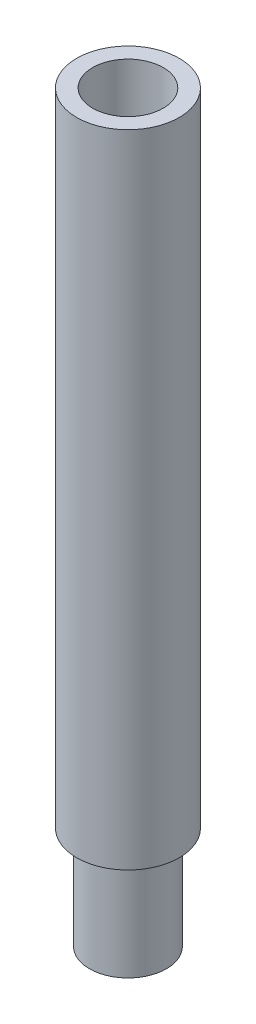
ISO-10303-21;
HEADER;
FILE_DESCRIPTION(('STEP AP214'),'2;1');
FILE_NAME('part.step','',(''),(''),'','','');
FILE_SCHEMA(('AUTOMOTIVE_DESIGN { 1 0 10303 214 1 1 1 1 }'));
ENDSEC;
DATA;
#1=APPLICATION_CONTEXT('core data for automotive mechanical design processes');
#2=APPLICATION_PROTOCOL_DEFINITION('international standard','automotive_design',2000,#1);
#3=PRODUCT_CONTEXT('',#1,'mechanical');
#4=PRODUCT('Part','Part','',(#3));
#5=PRODUCT_RELATED_PRODUCT_CATEGORY('part','',(#4));
#6=PRODUCT_DEFINITION_FORMATION('','',#4);
#7=PRODUCT_DEFINITION_CONTEXT('part definition',#1,'design');
#8=PRODUCT_DEFINITION('design','',#6,#7);
#9=PRODUCT_DEFINITION_SHAPE('','',#8);
#10=(LENGTH_UNIT() NAMED_UNIT(*) SI_UNIT(.MILLI.,.METRE.));
#11=(NAMED_UNIT(*) PLANE_ANGLE_UNIT() SI_UNIT($,.RADIAN.));
#12=(NAMED_UNIT(*) SI_UNIT($,.STERADIAN.) SOLID_ANGLE_UNIT());
#13=UNCERTAINTY_MEASURE_WITH_UNIT(LENGTH_MEASURE(1.E-05),#10,'distance_accuracy_value','');
#14=(GEOMETRIC_REPRESENTATION_CONTEXT(3) GLOBAL_UNCERTAINTY_ASSIGNED_CONTEXT((#13)) GLOBAL_UNIT_ASSIGNED_CONTEXT((#10,
#11,#12)) REPRESENTATION_CONTEXT('',''));
#15=CARTESIAN_POINT('',(0.,0.,0.));
#16=DIRECTION('',(0.,0.,1.));
#17=DIRECTION('',(1.,0.,0.));
#18=AXIS2_PLACEMENT_3D('',#15,#16,#17);
#19=CARTESIAN_POINT('',(0.,0.,0.));
#20=DIRECTION('',(0.,1.,0.));
#21=DIRECTION('',(0.,0.,1.));
#22=AXIS2_PLACEMENT_3D('',#19,#20,#21);
#23=PLANE('',#22);
#24=CARTESIAN_POINT('',(0.,0.,0.));
#25=DIRECTION('',(0.,-1.,0.));
#26=DIRECTION('',(0.,0.,-1.));
#27=AXIS2_PLACEMENT_3D('',#24,#25,#26);
#28=CIRCLE('',#27,3.45439999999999);
#29=CARTESIAN_POINT('',(0.,0.,-3.45439999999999));
#30=VERTEX_POINT('',#29);
#31=EDGE_CURVE('E52',#30,#30,#28,.T.);
#32=ORIENTED_EDGE('',*,*,#31,.F.);
#33=EDGE_LOOP('',(#32));
#34=FACE_BOUND('',#33,.T.);
#35=CARTESIAN_POINT('',(0.,0.,0.));
#36=DIRECTION('',(0.,1.,0.));
#37=DIRECTION('',(0.,0.,1.));
#38=AXIS2_PLACEMENT_3D('',#35,#36,#37);
#39=CIRCLE('',#38,9.525);
#40=CARTESIAN_POINT('',(0.,0.,9.525));
#41=VERTEX_POINT('',#40);
#42=EDGE_CURVE('E11',#41,#41,#39,.T.);
#43=ORIENTED_EDGE('',*,*,#42,.F.);
#44=EDGE_LOOP('',(#43));
#45=FACE_BOUND('',#44,.T.);
#46=ADVANCED_FACE('F32',(#34,#45),#23,.F.);
#47=CARTESIAN_POINT('',(0.,0.,0.));
#48=DIRECTION('',(0.,1.,0.));
#49=DIRECTION('',(0.,0.,1.));
#50=AXIS2_PLACEMENT_3D('',#47,#48,#49);
#51=CYLINDRICAL_SURFACE('',#50,9.525);
#52=CARTESIAN_POINT('',(0.,25.4,0.));
#53=DIRECTION('',(0.,1.,0.));
#54=DIRECTION('',(0.,0.,1.));
#55=AXIS2_PLACEMENT_3D('',#52,#53,#54);
#56=CIRCLE('',#55,9.525);
#57=CARTESIAN_POINT('',(0.,25.4,9.525));
#58=VERTEX_POINT('',#57);
#59=EDGE_CURVE('E38',#58,#58,#56,.T.);
#60=ORIENTED_EDGE('',*,*,#59,.F.);
#61=EDGE_LOOP('',(#60));
#62=FACE_BOUND('',#61,.T.);
#63=ORIENTED_EDGE('',*,*,#42,.T.);
#64=EDGE_LOOP('',(#63));
#65=FACE_BOUND('',#64,.T.);
#66=ADVANCED_FACE('F72',(#62,#65),#51,.T.);
#67=CARTESIAN_POINT('',(9.525,25.4,0.));
#68=DIRECTION('',(0.,1.,0.));
#69=DIRECTION('',(0.,0.,1.));
#70=AXIS2_PLACEMENT_3D('',#67,#68,#69);
#71=PLANE('',#70);
#72=CARTESIAN_POINT('',(0.,25.4,0.));
#73=DIRECTION('',(0.,1.,0.));
#74=DIRECTION('',(0.,0.,1.));
#75=AXIS2_PLACEMENT_3D('',#72,#73,#74);
#76=CIRCLE('',#75,12.7);
#77=CARTESIAN_POINT('',(0.,25.4,12.7));
#78=VERTEX_POINT('',#77);
#79=EDGE_CURVE('E65',#78,#78,#76,.T.);
#80=ORIENTED_EDGE('',*,*,#79,.F.);
#81=EDGE_LOOP('',(#80));
#82=FACE_BOUND('',#81,.T.);
#83=ORIENTED_EDGE('',*,*,#59,.T.);
#84=EDGE_LOOP('',(#83));
#85=FACE_BOUND('',#84,.T.);
#86=ADVANCED_FACE('F70',(#82,#85),#71,.F.);
#87=CARTESIAN_POINT('',(0.,0.,0.));
#88=DIRECTION('',(0.,1.,0.));
#89=DIRECTION('',(0.,0.,1.));
#90=AXIS2_PLACEMENT_3D('',#87,#88,#89);
#91=CYLINDRICAL_SURFACE('',#90,12.7);
#92=CARTESIAN_POINT('',(0.,184.15,0.));
#93=DIRECTION('',(0.,1.,0.));
#94=DIRECTION('',(0.,0.,1.));
#95=AXIS2_PLACEMENT_3D('',#92,#93,#94);
#96=CIRCLE('',#95,12.7);
#97=CARTESIAN_POINT('',(0.,184.15,12.7));
#98=VERTEX_POINT('',#97);
#99=EDGE_CURVE('E62',#98,#98,#96,.T.);
#100=ORIENTED_EDGE('',*,*,#99,.F.);
#101=EDGE_LOOP('',(#100));
#102=FACE_BOUND('',#101,.T.);
#103=ORIENTED_EDGE('',*,*,#79,.T.);
#104=EDGE_LOOP('',(#103));
#105=FACE_BOUND('',#104,.T.);
#106=ADVANCED_FACE('F98',(#102,#105),#91,.T.);
#107=CARTESIAN_POINT('',(12.7,184.15,0.));
#108=DIRECTION('',(0.,-1.,0.));
#109=DIRECTION('',(0.,0.,-1.));
#110=AXIS2_PLACEMENT_3D('',#107,#108,#109);
#111=PLANE('',#110);
#112=CARTESIAN_POINT('',(0.,184.15,0.));
#113=DIRECTION('',(0.,1.,0.));
#114=DIRECTION('',(0.,0.,1.));
#115=AXIS2_PLACEMENT_3D('',#112,#113,#114);
#116=CIRCLE('',#115,8.73124999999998);
#117=CARTESIAN_POINT('',(0.,184.15,8.73124999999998));
#118=VERTEX_POINT('',#117);
#119=EDGE_CURVE('E55',#118,#118,#116,.T.);
#120=ORIENTED_EDGE('',*,*,#119,.F.);
#121=EDGE_LOOP('',(#120));
#122=FACE_BOUND('',#121,.T.);
#123=ORIENTED_EDGE('',*,*,#99,.T.);
#124=EDGE_LOOP('',(#123));
#125=FACE_BOUND('',#124,.T.);
#126=ADVANCED_FACE('F94',(#122,#125),#111,.F.);
#127=CARTESIAN_POINT('',(0.,0.,0.));
#128=DIRECTION('',(0.,1.,0.));
#129=DIRECTION('',(0.,0.,1.));
#130=AXIS2_PLACEMENT_3D('',#127,#128,#129);
#131=CYLINDRICAL_SURFACE('',#130,8.73124999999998);
#132=CARTESIAN_POINT('',(0.,155.575,0.));
#133=DIRECTION('',(0.,1.,0.));
#134=DIRECTION('',(0.,0.,1.));
#135=AXIS2_PLACEMENT_3D('',#132,#133,#134);
#136=CIRCLE('',#135,8.73124999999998);
#137=CARTESIAN_POINT('',(0.,155.575,8.73124999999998));
#138=VERTEX_POINT('',#137);
#139=EDGE_CURVE('E51',#138,#138,#136,.T.);
#140=ORIENTED_EDGE('',*,*,#139,.F.);
#141=EDGE_LOOP('',(#140));
#142=FACE_BOUND('',#141,.T.);
#143=ORIENTED_EDGE('',*,*,#119,.T.);
#144=EDGE_LOOP('',(#143));
#145=FACE_BOUND('',#144,.T.);
#146=ADVANCED_FACE('F90',(#142,#145),#131,.F.);
#147=CARTESIAN_POINT('',(8.73124999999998,155.575,0.));
#148=DIRECTION('',(0.,-1.,0.));
#149=DIRECTION('',(0.,0.,-1.));
#150=AXIS2_PLACEMENT_3D('',#147,#148,#149);
#151=PLANE('',#150);
#152=ORIENTED_EDGE('',*,*,#139,.T.);
#153=EDGE_LOOP('',(#152));
#154=FACE_BOUND('',#153,.T.);
#155=ADVANCED_FACE('F45',(#154),#151,.F.);
#156=CARTESIAN_POINT('',(0.,21.336,0.));
#157=DIRECTION('',(0.,-1.,0.));
#158=DIRECTION('',(0.,0.,-1.));
#159=AXIS2_PLACEMENT_3D('',#156,#157,#158);
#160=CONICAL_SURFACE('',#159,3.45439999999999,1.02974425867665);
#161=CARTESIAN_POINT('',(0.,23.4116129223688,0.));
#162=VERTEX_POINT('',#161);
#163=VERTEX_LOOP('',#162);
#164=FACE_BOUND('',#163,.T.);
#165=CARTESIAN_POINT('',(0.,21.336,0.));
#166=DIRECTION('',(0.,-1.,0.));
#167=DIRECTION('',(0.,0.,-1.));
#168=AXIS2_PLACEMENT_3D('',#165,#166,#167);
#169=CIRCLE('',#168,3.45439999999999);
#170=CARTESIAN_POINT('',(0.,21.336,-3.45439999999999));
#171=VERTEX_POINT('',#170);
#172=EDGE_CURVE('E49',#171,#171,#169,.T.);
#173=ORIENTED_EDGE('',*,*,#172,.T.);
#174=EDGE_LOOP('',(#173));
#175=FACE_BOUND('',#174,.T.);
#176=ADVANCED_FACE('F41',(#164,#175),#160,.F.);
#177=CARTESIAN_POINT('',(0.,0.,0.));
#178=DIRECTION('',(0.,-1.,0.));
#179=DIRECTION('',(0.,0.,-1.));
#180=AXIS2_PLACEMENT_3D('',#177,#178,#179);
#181=CYLINDRICAL_SURFACE('',#180,3.45439999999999);
#182=ORIENTED_EDGE('',*,*,#172,.F.);
#183=EDGE_LOOP('',(#182));
#184=FACE_BOUND('',#183,.T.);
#185=ORIENTED_EDGE('',*,*,#31,.T.);
#186=EDGE_LOOP('',(#185));
#187=FACE_BOUND('',#186,.T.);
#188=ADVANCED_FACE('F44',(#184,#187),#181,.F.);
#189=CLOSED_SHELL('',(#46,#66,#86,#106,#126,#146,#155,#176,#188));
#190=MANIFOLD_SOLID_BREP('B2',#189);
#191=ADVANCED_BREP_SHAPE_REPRESENTATION('',(#18,#190),#14);
#192=SHAPE_DEFINITION_REPRESENTATION(#9,#191);
ENDSEC;
END-ISO-10303-21;
